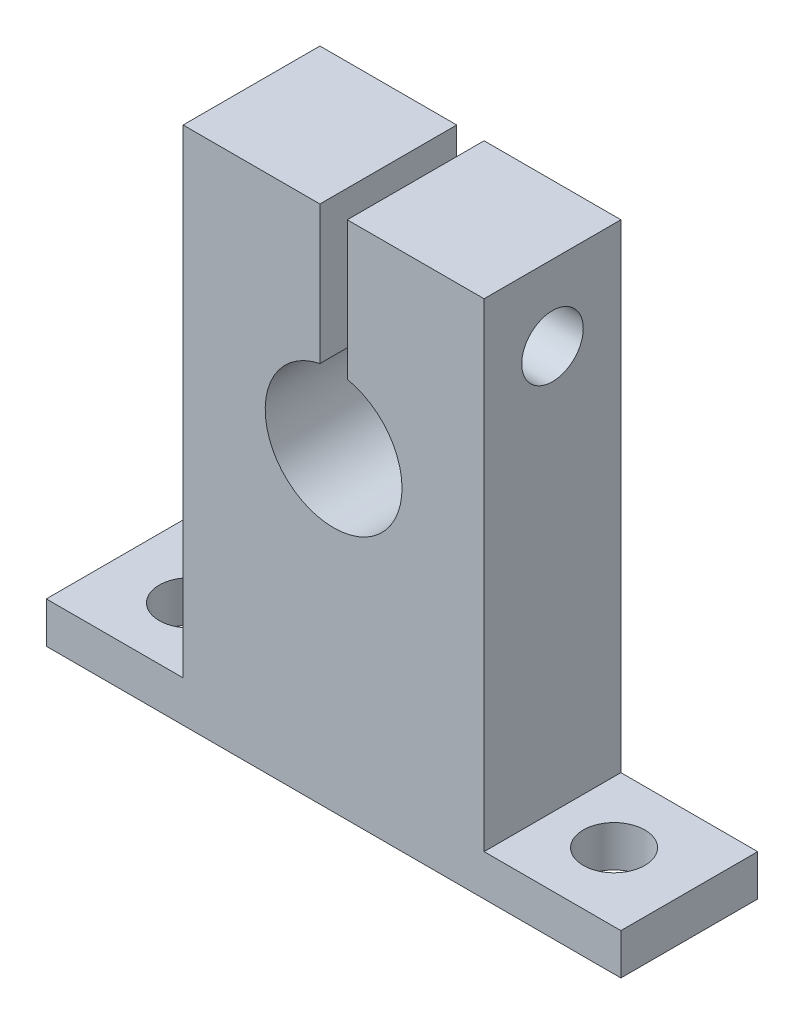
ISO-10303-21;
HEADER;
FILE_DESCRIPTION(('STEP AP214'),'2;1');
FILE_NAME('part.step','',(''),(''),'','','');
FILE_SCHEMA(('AUTOMOTIVE_DESIGN { 1 0 10303 214 1 1 1 1 }'));
ENDSEC;
DATA;
#1=APPLICATION_CONTEXT('core data for automotive mechanical design processes');
#2=APPLICATION_PROTOCOL_DEFINITION('international standard','automotive_design',2000,#1);
#3=PRODUCT_CONTEXT('',#1,'mechanical');
#4=PRODUCT('Part','Part','',(#3));
#5=PRODUCT_RELATED_PRODUCT_CATEGORY('part','',(#4));
#6=PRODUCT_DEFINITION_FORMATION('','',#4);
#7=PRODUCT_DEFINITION_CONTEXT('part definition',#1,'design');
#8=PRODUCT_DEFINITION('design','',#6,#7);
#9=PRODUCT_DEFINITION_SHAPE('','',#8);
#10=(LENGTH_UNIT() NAMED_UNIT(*) SI_UNIT(.MILLI.,.METRE.));
#11=(NAMED_UNIT(*) PLANE_ANGLE_UNIT() SI_UNIT($,.RADIAN.));
#12=(NAMED_UNIT(*) SI_UNIT($,.STERADIAN.) SOLID_ANGLE_UNIT());
#13=UNCERTAINTY_MEASURE_WITH_UNIT(LENGTH_MEASURE(1.E-05),#10,'distance_accuracy_value','');
#14=(GEOMETRIC_REPRESENTATION_CONTEXT(3) GLOBAL_UNCERTAINTY_ASSIGNED_CONTEXT((#13)) GLOBAL_UNIT_ASSIGNED_CONTEXT((#10,
#11,#12)) REPRESENTATION_CONTEXT('',''));
#15=CARTESIAN_POINT('',(0.,0.,0.));
#16=DIRECTION('',(0.,0.,1.));
#17=DIRECTION('',(1.,0.,0.));
#18=AXIS2_PLACEMENT_3D('',#15,#16,#17);
#19=CARTESIAN_POINT('',(-11.,15.,10.));
#20=DIRECTION('',(0.,-1.,0.));
#21=DIRECTION('',(0.,0.,-1.));
#22=AXIS2_PLACEMENT_3D('',#19,#20,#21);
#23=PLANE('',#22);
#24=DIRECTION('',(-1.,0.,0.));
#25=VECTOR('',#24,1.);
#26=CARTESIAN_POINT('',(-11.,15.,0.));
#27=LINE('',#26,#25);
#28=CARTESIAN_POINT('',(11.,15.,0.));
#29=VERTEX_POINT('',#28);
#30=CARTESIAN_POINT('',(1.,15.,0.));
#31=VERTEX_POINT('',#30);
#32=EDGE_CURVE('E146',#29,#31,#27,.T.);
#33=ORIENTED_EDGE('',*,*,#32,.T.);
#34=DIRECTION('',(0.,0.,-1.));
#35=VECTOR('',#34,1.);
#36=CARTESIAN_POINT('',(1.,15.,0.));
#37=LINE('',#36,#35);
#38=CARTESIAN_POINT('',(1.,15.,10.));
#39=VERTEX_POINT('',#38);
#40=EDGE_CURVE('E132',#39,#31,#37,.T.);
#41=ORIENTED_EDGE('',*,*,#40,.F.);
#42=DIRECTION('',(-1.,0.,0.));
#43=VECTOR('',#42,1.);
#44=CARTESIAN_POINT('',(-11.,15.,10.));
#45=LINE('',#44,#43);
#46=CARTESIAN_POINT('',(11.,15.,10.));
#47=VERTEX_POINT('',#46);
#48=EDGE_CURVE('E223',#47,#39,#45,.T.);
#49=ORIENTED_EDGE('',*,*,#48,.F.);
#50=DIRECTION('',(0.,0.,-1.));
#51=VECTOR('',#50,1.);
#52=CARTESIAN_POINT('',(11.,15.,10.));
#53=LINE('',#52,#51);
#54=EDGE_CURVE('E11',#47,#29,#53,.T.);
#55=ORIENTED_EDGE('',*,*,#54,.T.);
#56=EDGE_LOOP('',(#33,#41,#49,#55));
#57=FACE_BOUND('',#56,.T.);
#58=ADVANCED_FACE('F33',(#57),#23,.F.);
#59=CARTESIAN_POINT('',(-19.,9.5,5.));
#60=DIRECTION('',(1.,0.,0.));
#61=DIRECTION('',(0.,0.,-1.));
#62=AXIS2_PLACEMENT_3D('',#59,#60,#61);
#63=CYLINDRICAL_SURFACE('',#62,2.25);
#64=CARTESIAN_POINT('',(1.,9.5,5.));
#65=DIRECTION('',(1.,0.,0.));
#66=DIRECTION('',(0.,0.,-1.));
#67=AXIS2_PLACEMENT_3D('',#64,#65,#66);
#68=CIRCLE('',#67,2.25);
#69=CARTESIAN_POINT('',(1.,9.5,2.75));
#70=VERTEX_POINT('',#69);
#71=EDGE_CURVE('E37',#70,#70,#68,.F.);
#72=ORIENTED_EDGE('',*,*,#71,.T.);
#73=EDGE_LOOP('',(#72));
#74=FACE_BOUND('',#73,.T.);
#75=CARTESIAN_POINT('',(11.,9.5,5.));
#76=DIRECTION('',(1.,0.,0.));
#77=DIRECTION('',(0.,0.,-1.));
#78=AXIS2_PLACEMENT_3D('',#75,#76,#77);
#79=CIRCLE('',#78,2.25);
#80=CARTESIAN_POINT('',(11.,9.5,2.75));
#81=VERTEX_POINT('',#80);
#82=EDGE_CURVE('E195',#81,#81,#79,.T.);
#83=ORIENTED_EDGE('',*,*,#82,.T.);
#84=EDGE_LOOP('',(#83));
#85=FACE_BOUND('',#84,.T.);
#86=ADVANCED_FACE('F261',(#74,#85),#63,.F.);
#87=CARTESIAN_POINT('',(0.,0.,10.));
#88=DIRECTION('',(0.,0.,1.));
#89=DIRECTION('',(1.,0.,0.));
#90=AXIS2_PLACEMENT_3D('',#87,#88,#89);
#91=PLANE('',#90);
#92=DIRECTION('',(0.,1.,0.));
#93=VECTOR('',#92,1.);
#94=CARTESIAN_POINT('',(1.,0.,10.));
#95=LINE('',#94,#93);
#96=CARTESIAN_POINT('',(1.,4.89897948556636,10.));
#97=VERTEX_POINT('',#96);
#98=EDGE_CURVE('E201',#97,#39,#95,.T.);
#99=ORIENTED_EDGE('',*,*,#98,.F.);
#100=CARTESIAN_POINT('',(0.,0.,10.));
#101=DIRECTION('',(0.,0.,1.));
#102=DIRECTION('',(1.,0.,0.));
#103=AXIS2_PLACEMENT_3D('',#100,#101,#102);
#104=CIRCLE('',#103,5.);
#105=CARTESIAN_POINT('',(-0.999999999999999,4.89897948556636,10.));
#106=VERTEX_POINT('',#105);
#107=EDGE_CURVE('E150',#106,#97,#104,.T.);
#108=ORIENTED_EDGE('',*,*,#107,.F.);
#109=DIRECTION('',(0.,1.,0.));
#110=VECTOR('',#109,1.);
#111=CARTESIAN_POINT('',(-0.999999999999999,0.,10.));
#112=LINE('',#111,#110);
#113=CARTESIAN_POINT('',(-0.999999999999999,15.,10.));
#114=VERTEX_POINT('',#113);
#115=EDGE_CURVE('E58',#106,#114,#112,.T.);
#116=ORIENTED_EDGE('',*,*,#115,.T.);
#117=CARTESIAN_POINT('',(-11.,15.,10.));
#118=VERTEX_POINT('',#117);
#119=EDGE_CURVE('E140',#114,#118,#45,.T.);
#120=ORIENTED_EDGE('',*,*,#119,.T.);
#121=DIRECTION('',(0.,-1.,0.));
#122=VECTOR('',#121,1.);
#123=CARTESIAN_POINT('',(-11.,3.,10.));
#124=LINE('',#123,#122);
#125=CARTESIAN_POINT('',(-11.,-20.,10.));
#126=VERTEX_POINT('',#125);
#127=EDGE_CURVE('E226',#118,#126,#124,.T.);
#128=ORIENTED_EDGE('',*,*,#127,.T.);
#129=DIRECTION('',(-1.,0.,0.));
#130=VECTOR('',#129,1.);
#131=CARTESIAN_POINT('',(-11.,-20.,10.));
#132=LINE('',#131,#130);
#133=CARTESIAN_POINT('',(-21.,-20.,10.));
#134=VERTEX_POINT('',#133);
#135=EDGE_CURVE('E228',#126,#134,#132,.T.);
#136=ORIENTED_EDGE('',*,*,#135,.T.);
#137=DIRECTION('',(0.,-1.,0.));
#138=VECTOR('',#137,1.);
#139=CARTESIAN_POINT('',(-21.,-20.,10.));
#140=LINE('',#139,#138);
#141=CARTESIAN_POINT('',(-21.,-23.,10.));
#142=VERTEX_POINT('',#141);
#143=EDGE_CURVE('E230',#134,#142,#140,.T.);
#144=ORIENTED_EDGE('',*,*,#143,.T.);
#145=DIRECTION('',(1.,0.,0.));
#146=VECTOR('',#145,1.);
#147=CARTESIAN_POINT('',(21.,-23.,10.));
#148=LINE('',#147,#146);
#149=CARTESIAN_POINT('',(21.,-23.,10.));
#150=VERTEX_POINT('',#149);
#151=EDGE_CURVE('E232',#142,#150,#148,.T.);
#152=ORIENTED_EDGE('',*,*,#151,.T.);
#153=DIRECTION('',(0.,1.,0.));
#154=VECTOR('',#153,1.);
#155=CARTESIAN_POINT('',(21.,-20.,10.));
#156=LINE('',#155,#154);
#157=CARTESIAN_POINT('',(21.,-20.,10.));
#158=VERTEX_POINT('',#157);
#159=EDGE_CURVE('E234',#150,#158,#156,.T.);
#160=ORIENTED_EDGE('',*,*,#159,.T.);
#161=DIRECTION('',(-1.,0.,0.));
#162=VECTOR('',#161,1.);
#163=CARTESIAN_POINT('',(11.,-20.,10.));
#164=LINE('',#163,#162);
#165=CARTESIAN_POINT('',(11.,-20.,10.));
#166=VERTEX_POINT('',#165);
#167=EDGE_CURVE('E171',#158,#166,#164,.T.);
#168=ORIENTED_EDGE('',*,*,#167,.T.);
#169=DIRECTION('',(0.,1.,0.));
#170=VECTOR('',#169,1.);
#171=CARTESIAN_POINT('',(11.,3.,10.));
#172=LINE('',#171,#170);
#173=EDGE_CURVE('E166',#166,#47,#172,.T.);
#174=ORIENTED_EDGE('',*,*,#173,.T.);
#175=ORIENTED_EDGE('',*,*,#48,.T.);
#176=EDGE_LOOP('',(#99,#108,#116,#120,#128,#136,#144,#152,#160,#168,#174,#175));
#177=FACE_BOUND('',#176,.T.);
#178=ADVANCED_FACE('F239',(#177),#91,.T.);
#179=CARTESIAN_POINT('',(0.,0.,0.));
#180=DIRECTION('',(0.,0.,1.));
#181=DIRECTION('',(1.,0.,0.));
#182=AXIS2_PLACEMENT_3D('',#179,#180,#181);
#183=PLANE('',#182);
#184=CARTESIAN_POINT('',(0.,0.,0.));
#185=DIRECTION('',(0.,0.,1.));
#186=DIRECTION('',(1.,0.,0.));
#187=AXIS2_PLACEMENT_3D('',#184,#185,#186);
#188=CIRCLE('',#187,5.);
#189=CARTESIAN_POINT('',(-0.999999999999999,4.89897948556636,0.));
#190=VERTEX_POINT('',#189);
#191=CARTESIAN_POINT('',(1.,4.89897948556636,0.));
#192=VERTEX_POINT('',#191);
#193=EDGE_CURVE('E190',#190,#192,#188,.T.);
#194=ORIENTED_EDGE('',*,*,#193,.T.);
#195=DIRECTION('',(0.,1.,0.));
#196=VECTOR('',#195,1.);
#197=CARTESIAN_POINT('',(1.,0.,0.));
#198=LINE('',#197,#196);
#199=EDGE_CURVE('E50',#192,#31,#198,.T.);
#200=ORIENTED_EDGE('',*,*,#199,.T.);
#201=ORIENTED_EDGE('',*,*,#32,.F.);
#202=DIRECTION('',(0.,1.,0.));
#203=VECTOR('',#202,1.);
#204=CARTESIAN_POINT('',(11.,15.,0.));
#205=LINE('',#204,#203);
#206=CARTESIAN_POINT('',(11.,-20.,0.));
#207=VERTEX_POINT('',#206);
#208=EDGE_CURVE('E147',#207,#29,#205,.T.);
#209=ORIENTED_EDGE('',*,*,#208,.F.);
#210=DIRECTION('',(-1.,0.,0.));
#211=VECTOR('',#210,1.);
#212=CARTESIAN_POINT('',(11.,-20.,0.));
#213=LINE('',#212,#211);
#214=CARTESIAN_POINT('',(21.,-20.,0.));
#215=VERTEX_POINT('',#214);
#216=EDGE_CURVE('E163',#215,#207,#213,.T.);
#217=ORIENTED_EDGE('',*,*,#216,.F.);
#218=DIRECTION('',(0.,1.,0.));
#219=VECTOR('',#218,1.);
#220=CARTESIAN_POINT('',(21.,-20.,0.));
#221=LINE('',#220,#219);
#222=CARTESIAN_POINT('',(21.,-23.,0.));
#223=VERTEX_POINT('',#222);
#224=EDGE_CURVE('E161',#223,#215,#221,.T.);
#225=ORIENTED_EDGE('',*,*,#224,.F.);
#226=DIRECTION('',(1.,0.,0.));
#227=VECTOR('',#226,1.);
#228=CARTESIAN_POINT('',(21.,-23.,0.));
#229=LINE('',#228,#227);
#230=CARTESIAN_POINT('',(-21.,-23.,0.));
#231=VERTEX_POINT('',#230);
#232=EDGE_CURVE('E159',#231,#223,#229,.T.);
#233=ORIENTED_EDGE('',*,*,#232,.F.);
#234=DIRECTION('',(0.,-1.,0.));
#235=VECTOR('',#234,1.);
#236=CARTESIAN_POINT('',(-21.,-20.,0.));
#237=LINE('',#236,#235);
#238=CARTESIAN_POINT('',(-21.,-20.,0.));
#239=VERTEX_POINT('',#238);
#240=EDGE_CURVE('E157',#239,#231,#237,.T.);
#241=ORIENTED_EDGE('',*,*,#240,.F.);
#242=DIRECTION('',(-1.,0.,0.));
#243=VECTOR('',#242,1.);
#244=CARTESIAN_POINT('',(-11.,-20.,0.));
#245=LINE('',#244,#243);
#246=CARTESIAN_POINT('',(-11.,-20.,0.));
#247=VERTEX_POINT('',#246);
#248=EDGE_CURVE('E155',#247,#239,#245,.T.);
#249=ORIENTED_EDGE('',*,*,#248,.F.);
#250=DIRECTION('',(0.,-1.,0.));
#251=VECTOR('',#250,1.);
#252=CARTESIAN_POINT('',(-11.,3.,0.));
#253=LINE('',#252,#251);
#254=CARTESIAN_POINT('',(-11.,15.,0.));
#255=VERTEX_POINT('',#254);
#256=EDGE_CURVE('E144',#255,#247,#253,.T.);
#257=ORIENTED_EDGE('',*,*,#256,.F.);
#258=CARTESIAN_POINT('',(-0.999999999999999,15.,0.));
#259=VERTEX_POINT('',#258);
#260=EDGE_CURVE('E138',#259,#255,#27,.T.);
#261=ORIENTED_EDGE('',*,*,#260,.F.);
#262=DIRECTION('',(0.,1.,0.));
#263=VECTOR('',#262,1.);
#264=CARTESIAN_POINT('',(-0.999999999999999,0.,0.));
#265=LINE('',#264,#263);
#266=EDGE_CURVE('E122',#190,#259,#265,.T.);
#267=ORIENTED_EDGE('',*,*,#266,.F.);
#268=EDGE_LOOP('',(#194,#200,#201,#209,#217,#225,#233,#241,#249,#257,#261,#267));
#269=FACE_BOUND('',#268,.T.);
#270=ADVANCED_FACE('F142',(#269),#183,.F.);
#271=CARTESIAN_POINT('',(11.,15.,10.));
#272=DIRECTION('',(-1.,0.,0.));
#273=DIRECTION('',(0.,0.,1.));
#274=AXIS2_PLACEMENT_3D('',#271,#272,#273);
#275=PLANE('',#274);
#276=ORIENTED_EDGE('',*,*,#82,.F.);
#277=EDGE_LOOP('',(#276));
#278=FACE_BOUND('',#277,.T.);
#279=ORIENTED_EDGE('',*,*,#208,.T.);
#280=ORIENTED_EDGE('',*,*,#54,.F.);
#281=ORIENTED_EDGE('',*,*,#173,.F.);
#282=DIRECTION('',(0.,0.,-1.));
#283=VECTOR('',#282,1.);
#284=CARTESIAN_POINT('',(11.,-20.,10.));
#285=LINE('',#284,#283);
#286=EDGE_CURVE('E167',#166,#207,#285,.T.);
#287=ORIENTED_EDGE('',*,*,#286,.T.);
#288=EDGE_LOOP('',(#279,#280,#281,#287));
#289=FACE_BOUND('',#288,.T.);
#290=ADVANCED_FACE('F35',(#278,#289),#275,.F.);
#291=ORIENTED_EDGE('',*,*,#119,.F.);
#292=DIRECTION('',(0.,0.,1.));
#293=VECTOR('',#292,1.);
#294=CARTESIAN_POINT('',(-0.999999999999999,15.,10.));
#295=LINE('',#294,#293);
#296=EDGE_CURVE('E126',#259,#114,#295,.T.);
#297=ORIENTED_EDGE('',*,*,#296,.F.);
#298=ORIENTED_EDGE('',*,*,#260,.T.);
#299=DIRECTION('',(0.,0.,-1.));
#300=VECTOR('',#299,1.);
#301=CARTESIAN_POINT('',(-11.,15.,10.));
#302=LINE('',#301,#300);
#303=EDGE_CURVE('E42',#118,#255,#302,.T.);
#304=ORIENTED_EDGE('',*,*,#303,.F.);
#305=EDGE_LOOP('',(#291,#297,#298,#304));
#306=FACE_BOUND('',#305,.T.);
#307=ADVANCED_FACE('F136',(#306),#23,.F.);
#308=CARTESIAN_POINT('',(-11.,3.,10.));
#309=DIRECTION('',(1.,0.,0.));
#310=DIRECTION('',(0.,0.,-1.));
#311=AXIS2_PLACEMENT_3D('',#308,#309,#310);
#312=PLANE('',#311);
#313=CARTESIAN_POINT('',(-11.,9.5,5.));
#314=DIRECTION('',(1.,0.,0.));
#315=DIRECTION('',(0.,0.,-1.));
#316=AXIS2_PLACEMENT_3D('',#313,#314,#315);
#317=CIRCLE('',#316,2.25);
#318=CARTESIAN_POINT('',(-11.,9.5,2.75));
#319=VERTEX_POINT('',#318);
#320=EDGE_CURVE('E192',#319,#319,#317,.T.);
#321=ORIENTED_EDGE('',*,*,#320,.T.);
#322=EDGE_LOOP('',(#321));
#323=FACE_BOUND('',#322,.T.);
#324=ORIENTED_EDGE('',*,*,#256,.T.);
#325=DIRECTION('',(0.,0.,-1.));
#326=VECTOR('',#325,1.);
#327=CARTESIAN_POINT('',(-11.,-20.,10.));
#328=LINE('',#327,#326);
#329=EDGE_CURVE('E183',#126,#247,#328,.T.);
#330=ORIENTED_EDGE('',*,*,#329,.F.);
#331=ORIENTED_EDGE('',*,*,#127,.F.);
#332=ORIENTED_EDGE('',*,*,#303,.T.);
#333=EDGE_LOOP('',(#324,#330,#331,#332));
#334=FACE_BOUND('',#333,.T.);
#335=ADVANCED_FACE('F273',(#323,#334),#312,.F.);
#336=CARTESIAN_POINT('',(-11.,-20.,10.));
#337=DIRECTION('',(0.,-1.,0.));
#338=DIRECTION('',(0.,0.,-1.));
#339=AXIS2_PLACEMENT_3D('',#336,#337,#338);
#340=PLANE('',#339);
#341=CARTESIAN_POINT('',(-15.5,-20.,5.));
#342=DIRECTION('',(0.,1.,0.));
#343=DIRECTION('',(0.,0.,1.));
#344=AXIS2_PLACEMENT_3D('',#341,#342,#343);
#345=CIRCLE('',#344,2.25);
#346=CARTESIAN_POINT('',(-15.5,-20.,7.25));
#347=VERTEX_POINT('',#346);
#348=EDGE_CURVE('E191',#347,#347,#345,.T.);
#349=ORIENTED_EDGE('',*,*,#348,.F.);
#350=EDGE_LOOP('',(#349));
#351=FACE_BOUND('',#350,.T.);
#352=ORIENTED_EDGE('',*,*,#248,.T.);
#353=DIRECTION('',(0.,0.,-1.));
#354=VECTOR('',#353,1.);
#355=CARTESIAN_POINT('',(-21.,-20.,10.));
#356=LINE('',#355,#354);
#357=EDGE_CURVE('E180',#134,#239,#356,.T.);
#358=ORIENTED_EDGE('',*,*,#357,.F.);
#359=ORIENTED_EDGE('',*,*,#135,.F.);
#360=ORIENTED_EDGE('',*,*,#329,.T.);
#361=EDGE_LOOP('',(#352,#358,#359,#360));
#362=FACE_BOUND('',#361,.T.);
#363=ADVANCED_FACE('F281',(#351,#362),#340,.F.);
#364=CARTESIAN_POINT('',(-21.,-20.,10.));
#365=DIRECTION('',(1.,0.,0.));
#366=DIRECTION('',(0.,0.,-1.));
#367=AXIS2_PLACEMENT_3D('',#364,#365,#366);
#368=PLANE('',#367);
#369=ORIENTED_EDGE('',*,*,#240,.T.);
#370=DIRECTION('',(0.,0.,-1.));
#371=VECTOR('',#370,1.);
#372=CARTESIAN_POINT('',(-21.,-23.,10.));
#373=LINE('',#372,#371);
#374=EDGE_CURVE('E177',#142,#231,#373,.T.);
#375=ORIENTED_EDGE('',*,*,#374,.F.);
#376=ORIENTED_EDGE('',*,*,#143,.F.);
#377=ORIENTED_EDGE('',*,*,#357,.T.);
#378=EDGE_LOOP('',(#369,#375,#376,#377));
#379=FACE_BOUND('',#378,.T.);
#380=ADVANCED_FACE('F285',(#379),#368,.F.);
#381=CARTESIAN_POINT('',(21.,-23.,10.));
#382=DIRECTION('',(0.,1.,0.));
#383=DIRECTION('',(0.,0.,1.));
#384=AXIS2_PLACEMENT_3D('',#381,#382,#383);
#385=PLANE('',#384);
#386=CARTESIAN_POINT('',(15.5,-23.,5.));
#387=DIRECTION('',(0.,1.,0.));
#388=DIRECTION('',(0.,0.,1.));
#389=AXIS2_PLACEMENT_3D('',#386,#387,#388);
#390=CIRCLE('',#389,2.25);
#391=CARTESIAN_POINT('',(15.5,-23.,7.25));
#392=VERTEX_POINT('',#391);
#393=EDGE_CURVE('E214',#392,#392,#390,.T.);
#394=ORIENTED_EDGE('',*,*,#393,.T.);
#395=EDGE_LOOP('',(#394));
#396=FACE_BOUND('',#395,.T.);
#397=CARTESIAN_POINT('',(-15.5,-23.,5.));
#398=DIRECTION('',(0.,1.,0.));
#399=DIRECTION('',(0.,0.,1.));
#400=AXIS2_PLACEMENT_3D('',#397,#398,#399);
#401=CIRCLE('',#400,2.25);
#402=CARTESIAN_POINT('',(-15.5,-23.,7.25));
#403=VERTEX_POINT('',#402);
#404=EDGE_CURVE('E187',#403,#403,#401,.T.);
#405=ORIENTED_EDGE('',*,*,#404,.T.);
#406=EDGE_LOOP('',(#405));
#407=FACE_BOUND('',#406,.T.);
#408=ORIENTED_EDGE('',*,*,#232,.T.);
#409=DIRECTION('',(0.,0.,-1.));
#410=VECTOR('',#409,1.);
#411=CARTESIAN_POINT('',(21.,-23.,10.));
#412=LINE('',#411,#410);
#413=EDGE_CURVE('E174',#150,#223,#412,.T.);
#414=ORIENTED_EDGE('',*,*,#413,.F.);
#415=ORIENTED_EDGE('',*,*,#151,.F.);
#416=ORIENTED_EDGE('',*,*,#374,.T.);
#417=EDGE_LOOP('',(#408,#414,#415,#416));
#418=FACE_BOUND('',#417,.T.);
#419=ADVANCED_FACE('F289',(#396,#407,#418),#385,.F.);
#420=CARTESIAN_POINT('',(21.,-20.,10.));
#421=DIRECTION('',(-1.,0.,0.));
#422=DIRECTION('',(0.,0.,1.));
#423=AXIS2_PLACEMENT_3D('',#420,#421,#422);
#424=PLANE('',#423);
#425=ORIENTED_EDGE('',*,*,#224,.T.);
#426=DIRECTION('',(0.,0.,-1.));
#427=VECTOR('',#426,1.);
#428=CARTESIAN_POINT('',(21.,-20.,10.));
#429=LINE('',#428,#427);
#430=EDGE_CURVE('E170',#158,#215,#429,.T.);
#431=ORIENTED_EDGE('',*,*,#430,.F.);
#432=ORIENTED_EDGE('',*,*,#159,.F.);
#433=ORIENTED_EDGE('',*,*,#413,.T.);
#434=EDGE_LOOP('',(#425,#431,#432,#433));
#435=FACE_BOUND('',#434,.T.);
#436=ADVANCED_FACE('F293',(#435),#424,.F.);
#437=CARTESIAN_POINT('',(11.,-20.,10.));
#438=DIRECTION('',(0.,-1.,0.));
#439=DIRECTION('',(0.,0.,-1.));
#440=AXIS2_PLACEMENT_3D('',#437,#438,#439);
#441=PLANE('',#440);
#442=CARTESIAN_POINT('',(15.5,-20.,5.));
#443=DIRECTION('',(0.,1.,0.));
#444=DIRECTION('',(0.,0.,1.));
#445=AXIS2_PLACEMENT_3D('',#442,#443,#444);
#446=CIRCLE('',#445,2.25);
#447=CARTESIAN_POINT('',(15.5,-20.,7.25));
#448=VERTEX_POINT('',#447);
#449=EDGE_CURVE('E194',#448,#448,#446,.T.);
#450=ORIENTED_EDGE('',*,*,#449,.F.);
#451=EDGE_LOOP('',(#450));
#452=FACE_BOUND('',#451,.T.);
#453=ORIENTED_EDGE('',*,*,#216,.T.);
#454=ORIENTED_EDGE('',*,*,#286,.F.);
#455=ORIENTED_EDGE('',*,*,#167,.F.);
#456=ORIENTED_EDGE('',*,*,#430,.T.);
#457=EDGE_LOOP('',(#453,#454,#455,#456));
#458=FACE_BOUND('',#457,.T.);
#459=ADVANCED_FACE('F245',(#452,#458),#441,.F.);
#460=CARTESIAN_POINT('',(0.,0.,10.));
#461=DIRECTION('',(0.,0.,-1.));
#462=DIRECTION('',(-1.,0.,0.));
#463=AXIS2_PLACEMENT_3D('',#460,#461,#462);
#464=CYLINDRICAL_SURFACE('',#463,5.);
#465=DIRECTION('',(0.,0.,-1.));
#466=VECTOR('',#465,1.);
#467=CARTESIAN_POINT('',(1.,4.89897948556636,10.));
#468=LINE('',#467,#466);
#469=EDGE_CURVE('E208',#192,#97,#468,.F.);
#470=ORIENTED_EDGE('',*,*,#469,.F.);
#471=ORIENTED_EDGE('',*,*,#193,.F.);
#472=DIRECTION('',(0.,0.,-1.));
#473=VECTOR('',#472,1.);
#474=CARTESIAN_POINT('',(-0.999999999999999,4.89897948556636,10.));
#475=LINE('',#474,#473);
#476=EDGE_CURVE('E127',#106,#190,#475,.T.);
#477=ORIENTED_EDGE('',*,*,#476,.F.);
#478=ORIENTED_EDGE('',*,*,#107,.T.);
#479=EDGE_LOOP('',(#470,#471,#477,#478));
#480=FACE_BOUND('',#479,.T.);
#481=ADVANCED_FACE('F253',(#480),#464,.F.);
#482=CARTESIAN_POINT('',(-15.5,-30.,5.));
#483=DIRECTION('',(0.,1.,0.));
#484=DIRECTION('',(0.,0.,1.));
#485=AXIS2_PLACEMENT_3D('',#482,#483,#484);
#486=CYLINDRICAL_SURFACE('',#485,2.25);
#487=ORIENTED_EDGE('',*,*,#348,.T.);
#488=EDGE_LOOP('',(#487));
#489=FACE_BOUND('',#488,.T.);
#490=ORIENTED_EDGE('',*,*,#404,.F.);
#491=EDGE_LOOP('',(#490));
#492=FACE_BOUND('',#491,.T.);
#493=ADVANCED_FACE('F305',(#489,#492),#486,.F.);
#494=CARTESIAN_POINT('',(15.5,-30.,5.));
#495=DIRECTION('',(0.,1.,0.));
#496=DIRECTION('',(0.,0.,1.));
#497=AXIS2_PLACEMENT_3D('',#494,#495,#496);
#498=CYLINDRICAL_SURFACE('',#497,2.25);
#499=ORIENTED_EDGE('',*,*,#449,.T.);
#500=EDGE_LOOP('',(#499));
#501=FACE_BOUND('',#500,.T.);
#502=ORIENTED_EDGE('',*,*,#393,.F.);
#503=EDGE_LOOP('',(#502));
#504=FACE_BOUND('',#503,.T.);
#505=ADVANCED_FACE('F308',(#501,#504),#498,.F.);
#506=CARTESIAN_POINT('',(-0.999999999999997,9.5,5.));
#507=DIRECTION('',(-1.,0.,0.));
#508=DIRECTION('',(0.,0.,1.));
#509=AXIS2_PLACEMENT_3D('',#506,#507,#508);
#510=CIRCLE('',#509,2.25);
#511=CARTESIAN_POINT('',(-0.999999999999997,9.5,7.25));
#512=VERTEX_POINT('',#511);
#513=EDGE_CURVE('E196',#512,#512,#510,.F.);
#514=ORIENTED_EDGE('',*,*,#513,.T.);
#515=EDGE_LOOP('',(#514));
#516=FACE_BOUND('',#515,.T.);
#517=ORIENTED_EDGE('',*,*,#320,.F.);
#518=EDGE_LOOP('',(#517));
#519=FACE_BOUND('',#518,.T.);
#520=ADVANCED_FACE('F265',(#516,#519),#63,.F.);
#521=CARTESIAN_POINT('',(-0.999999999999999,0.,10.));
#522=DIRECTION('',(-1.,0.,0.));
#523=DIRECTION('',(0.,0.,1.));
#524=AXIS2_PLACEMENT_3D('',#521,#522,#523);
#525=PLANE('',#524);
#526=ORIENTED_EDGE('',*,*,#476,.T.);
#527=ORIENTED_EDGE('',*,*,#266,.T.);
#528=ORIENTED_EDGE('',*,*,#296,.T.);
#529=ORIENTED_EDGE('',*,*,#115,.F.);
#530=EDGE_LOOP('',(#526,#527,#528,#529));
#531=FACE_BOUND('',#530,.T.);
#532=ORIENTED_EDGE('',*,*,#513,.F.);
#533=EDGE_LOOP('',(#532));
#534=FACE_BOUND('',#533,.T.);
#535=ADVANCED_FACE('F124',(#531,#534),#525,.F.);
#536=CARTESIAN_POINT('',(1.,0.,0.));
#537=DIRECTION('',(1.,0.,0.));
#538=DIRECTION('',(0.,0.,-1.));
#539=AXIS2_PLACEMENT_3D('',#536,#537,#538);
#540=PLANE('',#539);
#541=ORIENTED_EDGE('',*,*,#469,.T.);
#542=ORIENTED_EDGE('',*,*,#98,.T.);
#543=ORIENTED_EDGE('',*,*,#40,.T.);
#544=ORIENTED_EDGE('',*,*,#199,.F.);
#545=EDGE_LOOP('',(#541,#542,#543,#544));
#546=FACE_BOUND('',#545,.T.);
#547=ORIENTED_EDGE('',*,*,#71,.F.);
#548=EDGE_LOOP('',(#547));
#549=FACE_BOUND('',#548,.T.);
#550=ADVANCED_FACE('F254',(#546,#549),#540,.F.);
#551=CLOSED_SHELL('',(#58,#86,#178,#270,#290,#307,#335,#363,#380,#419,#436,#459,#481,#493,#505,
#520,#535,#550));
#552=MANIFOLD_SOLID_BREP('B2',#551);
#553=ADVANCED_BREP_SHAPE_REPRESENTATION('',(#18,#552),#14);
#554=SHAPE_DEFINITION_REPRESENTATION(#9,#553);
ENDSEC;
END-ISO-10303-21;
